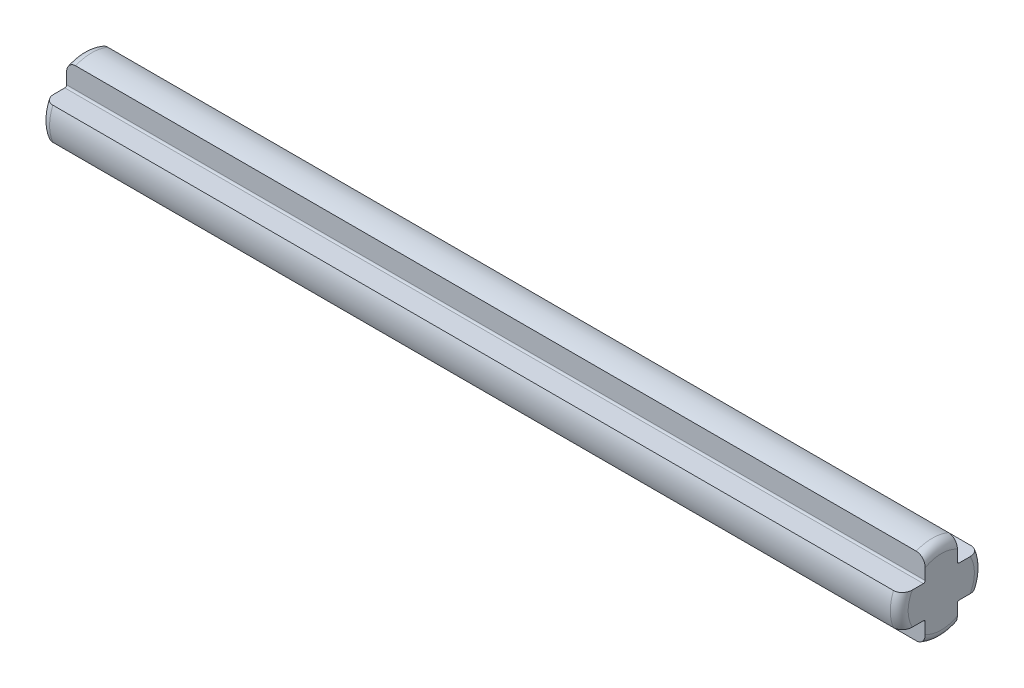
from build123d import *

# Parameters (mm, degrees)
EXTRUIR1_DEPTH = 24
REDONDEO1_R    = 0.5


with BuildPart() as part:
    # Croquis1 → Extruir1 (new, symmetric)
    with BuildSketch(Plane(origin=(0, 0, 0), x_dir=(0, 0, -1), z_dir=(1, 0, 0))):
        with BuildLine():
            Line((-0.9, 2.170829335), (-0.9, 1))
            ThreePointArc((-0.9, 1), (-0.929289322, 0.929289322), (-1, 0.9))
            Line((-1, 0.9), (-2.170829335, 0.9))
            ThreePointArc((-2.170829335, 0.9), (-2.35, 0), (-2.170829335, -0.9))
            Line((-2.170829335, -0.9), (-1, -0.9))
            ThreePointArc((-1, -0.9), (-0.929289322, -0.929289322), (-0.9, -1))
            Line((-0.9, -1), (-0.9, -2.170829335))
            ThreePointArc((-0.9, -2.170829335), (0, -2.35), (0.9, -2.170829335))
            Line((0.9, -2.170829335), (0.9, -1))
            ThreePointArc((0.9, -1), (0.929289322, -0.929289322), (1, -0.9))
            Line((1, -0.9), (2.170829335, -0.9))
            ThreePointArc((2.170829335, -0.9), (2.35, 0), (2.170829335, 0.9))
            Line((2.170829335, 0.9), (1, 0.9))
            ThreePointArc((1, 0.9), (0.929289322, 0.929289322), (0.9, 1))
            Line((0.9, 1), (0.9, 2.170829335))
            ThreePointArc((0.9, 2.170829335), (0, 2.35), (-0.9, 2.170829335))
        make_face()
    extrude(amount=EXTRUIR1_DEPTH, both=True)

    # Redondeo1
    redondeo1_edges = [part.edges().sort_by_distance(p)[0] for p in [
        (-24, 2.35, 0),
        (24, -2.35, 0),
        (-24, 0, -2.35),
        (-24, -2.35, 0),
        (-24, 0, 2.35),
        (24, 0, -2.35),
        (24, 0, 2.35),
        (24, 2.35, 0),
    ]]
    fillet(redondeo1_edges, radius=REDONDEO1_R)


solid = part.part
